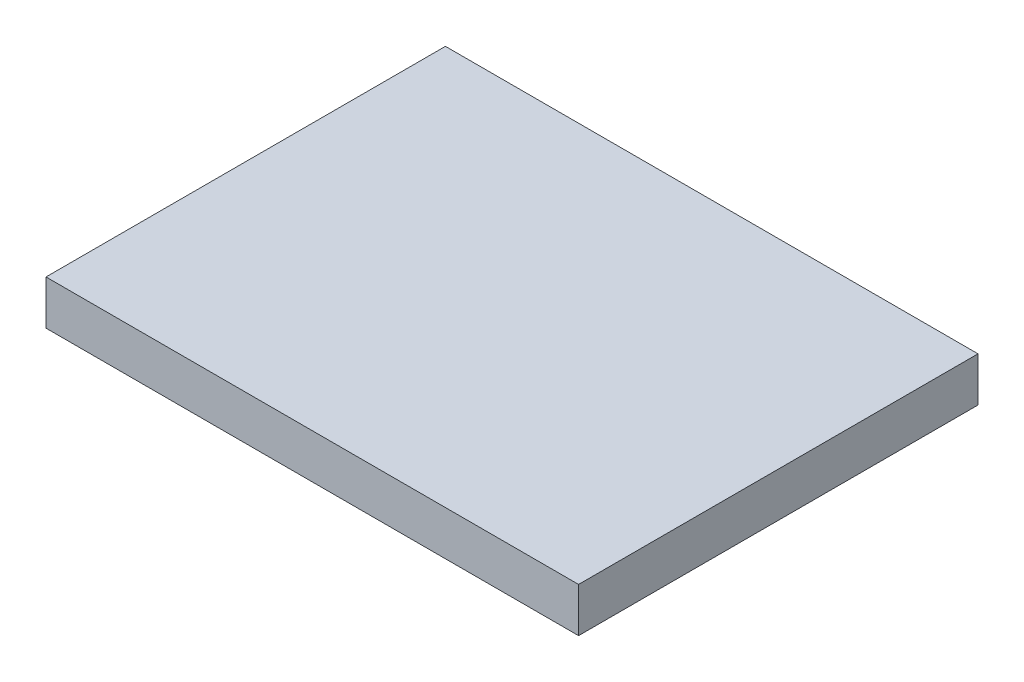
from build123d import *

# Parameters (mm, degrees)
ESQUISSE1_W        = 120
ESQUISSE1_H        = 10
BOSS_EXTRU_1_DEPTH = 90


with BuildPart() as part:
    # Esquisse1 → Boss.-Extru.1 (new body)
    with BuildSketch(Plane.XY):
        with Locations((0, 1311.5)):
            Rectangle(ESQUISSE1_W, ESQUISSE1_H)
    extrude(amount=BOSS_EXTRU_1_DEPTH)


solid = part.part
